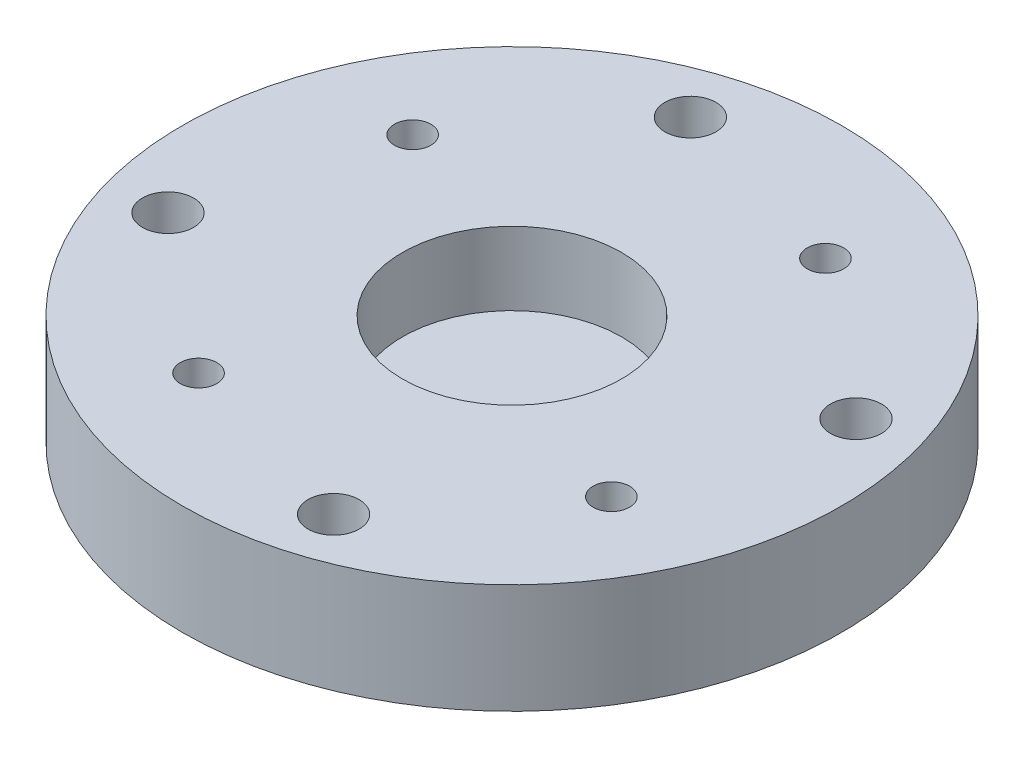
ISO-10303-21;
HEADER;
FILE_DESCRIPTION(('STEP AP214'),'2;1');
FILE_NAME('part.step','',(''),(''),'','','');
FILE_SCHEMA(('AUTOMOTIVE_DESIGN { 1 0 10303 214 1 1 1 1 }'));
ENDSEC;
DATA;
#1=APPLICATION_CONTEXT('core data for automotive mechanical design processes');
#2=APPLICATION_PROTOCOL_DEFINITION('international standard','automotive_design',2000,#1);
#3=PRODUCT_CONTEXT('',#1,'mechanical');
#4=PRODUCT('Part','Part','',(#3));
#5=PRODUCT_RELATED_PRODUCT_CATEGORY('part','',(#4));
#6=PRODUCT_DEFINITION_FORMATION('','',#4);
#7=PRODUCT_DEFINITION_CONTEXT('part definition',#1,'design');
#8=PRODUCT_DEFINITION('design','',#6,#7);
#9=PRODUCT_DEFINITION_SHAPE('','',#8);
#10=(LENGTH_UNIT() NAMED_UNIT(*) SI_UNIT(.MILLI.,.METRE.));
#11=(NAMED_UNIT(*) PLANE_ANGLE_UNIT() SI_UNIT($,.RADIAN.));
#12=(NAMED_UNIT(*) SI_UNIT($,.STERADIAN.) SOLID_ANGLE_UNIT());
#13=UNCERTAINTY_MEASURE_WITH_UNIT(LENGTH_MEASURE(1.E-05),#10,'distance_accuracy_value','');
#14=(GEOMETRIC_REPRESENTATION_CONTEXT(3) GLOBAL_UNCERTAINTY_ASSIGNED_CONTEXT((#13)) GLOBAL_UNIT_ASSIGNED_CONTEXT((#10,
#11,#12)) REPRESENTATION_CONTEXT('',''));
#15=CARTESIAN_POINT('',(0.,0.,0.));
#16=DIRECTION('',(0.,0.,1.));
#17=DIRECTION('',(1.,0.,0.));
#18=AXIS2_PLACEMENT_3D('',#15,#16,#17);
#19=CARTESIAN_POINT('',(0.,0.,0.));
#20=DIRECTION('',(0.,1.,0.));
#21=DIRECTION('',(0.,0.,1.));
#22=AXIS2_PLACEMENT_3D('',#19,#20,#21);
#23=PLANE('',#22);
#24=CARTESIAN_POINT('',(-28.2469511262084,0.,-14.6495649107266));
#25=DIRECTION('',(0.,-1.,0.));
#26=DIRECTION('',(0.,0.,-1.));
#27=AXIS2_PLACEMENT_3D('',#24,#25,#26);
#28=CIRCLE('',#27,2.5);
#29=CARTESIAN_POINT('',(-28.2469511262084,0.,-17.1495649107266));
#30=VERTEX_POINT('',#29);
#31=EDGE_CURVE('E116',#30,#30,#28,.T.);
#32=ORIENTED_EDGE('',*,*,#31,.F.);
#33=EDGE_LOOP('',(#32));
#34=FACE_BOUND('',#33,.T.);
#35=CARTESIAN_POINT('',(14.6495649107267,0.,-28.2469511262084));
#36=DIRECTION('',(0.,-1.,0.));
#37=DIRECTION('',(0.,0.,-1.));
#38=AXIS2_PLACEMENT_3D('',#35,#36,#37);
#39=CIRCLE('',#38,2.5);
#40=CARTESIAN_POINT('',(14.6495649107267,0.,-30.7469511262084));
#41=VERTEX_POINT('',#40);
#42=EDGE_CURVE('E110',#41,#41,#39,.T.);
#43=ORIENTED_EDGE('',*,*,#42,.F.);
#44=EDGE_LOOP('',(#43));
#45=FACE_BOUND('',#44,.T.);
#46=CARTESIAN_POINT('',(28.2469511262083,0.,14.6495649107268));
#47=DIRECTION('',(0.,-1.,0.));
#48=DIRECTION('',(0.,0.,-1.));
#49=AXIS2_PLACEMENT_3D('',#46,#47,#48);
#50=CIRCLE('',#49,2.5);
#51=CARTESIAN_POINT('',(28.2469511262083,0.,12.1495649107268));
#52=VERTEX_POINT('',#51);
#53=EDGE_CURVE('E104',#52,#52,#50,.T.);
#54=ORIENTED_EDGE('',*,*,#53,.F.);
#55=EDGE_LOOP('',(#54));
#56=FACE_BOUND('',#55,.T.);
#57=CARTESIAN_POINT('',(-14.6495649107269,0.,28.2469511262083));
#58=DIRECTION('',(0.,-1.,0.));
#59=DIRECTION('',(0.,0.,-1.));
#60=AXIS2_PLACEMENT_3D('',#57,#58,#59);
#61=CIRCLE('',#60,2.5);
#62=CARTESIAN_POINT('',(-14.6495649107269,0.,25.7469511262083));
#63=VERTEX_POINT('',#62);
#64=EDGE_CURVE('E98',#63,#63,#61,.T.);
#65=ORIENTED_EDGE('',*,*,#64,.F.);
#66=EDGE_LOOP('',(#65));
#67=FACE_BOUND('',#66,.T.);
#68=CARTESIAN_POINT('',(-11.3311551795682,0.,-35.7470966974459));
#69=DIRECTION('',(0.,-1.,0.));
#70=DIRECTION('',(0.,0.,-1.));
#71=AXIS2_PLACEMENT_3D('',#68,#69,#70);
#72=CIRCLE('',#71,6.);
#73=CARTESIAN_POINT('',(-11.3311551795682,0.,-41.7470966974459));
#74=VERTEX_POINT('',#73);
#75=EDGE_CURVE('E92',#74,#74,#72,.T.);
#76=ORIENTED_EDGE('',*,*,#75,.F.);
#77=EDGE_LOOP('',(#76));
#78=FACE_BOUND('',#77,.T.);
#79=CARTESIAN_POINT('',(35.7470966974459,0.,-11.3311551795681));
#80=DIRECTION('',(0.,-1.,0.));
#81=DIRECTION('',(0.,0.,-1.));
#82=AXIS2_PLACEMENT_3D('',#79,#80,#81);
#83=CIRCLE('',#82,6.);
#84=CARTESIAN_POINT('',(35.7470966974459,0.,-17.3311551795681));
#85=VERTEX_POINT('',#84);
#86=EDGE_CURVE('E80',#85,#85,#83,.T.);
#87=ORIENTED_EDGE('',*,*,#86,.F.);
#88=EDGE_LOOP('',(#87));
#89=FACE_BOUND('',#88,.T.);
#90=CARTESIAN_POINT('',(11.331155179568,0.,35.7470966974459));
#91=DIRECTION('',(0.,-1.,0.));
#92=DIRECTION('',(0.,0.,-1.));
#93=AXIS2_PLACEMENT_3D('',#90,#91,#92);
#94=CIRCLE('',#93,6.);
#95=CARTESIAN_POINT('',(11.331155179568,0.,29.7470966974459));
#96=VERTEX_POINT('',#95);
#97=EDGE_CURVE('E68',#96,#96,#94,.T.);
#98=ORIENTED_EDGE('',*,*,#97,.F.);
#99=EDGE_LOOP('',(#98));
#100=FACE_BOUND('',#99,.T.);
#101=CARTESIAN_POINT('',(-35.747096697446,0.,11.3311551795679));
#102=DIRECTION('',(0.,-1.,0.));
#103=DIRECTION('',(0.,0.,-1.));
#104=AXIS2_PLACEMENT_3D('',#101,#102,#103);
#105=CIRCLE('',#104,6.);
#106=CARTESIAN_POINT('',(-35.747096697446,0.,5.33115517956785));
#107=VERTEX_POINT('',#106);
#108=EDGE_CURVE('E56',#107,#107,#105,.T.);
#109=ORIENTED_EDGE('',*,*,#108,.F.);
#110=EDGE_LOOP('',(#109));
#111=FACE_BOUND('',#110,.T.);
#112=CARTESIAN_POINT('',(0.,0.,0.));
#113=DIRECTION('',(0.,1.,0.));
#114=DIRECTION('',(0.,0.,1.));
#115=AXIS2_PLACEMENT_3D('',#112,#113,#114);
#116=CIRCLE('',#115,45.1);
#117=CARTESIAN_POINT('',(0.,0.,45.1));
#118=VERTEX_POINT('',#117);
#119=EDGE_CURVE('E10',#118,#118,#116,.T.);
#120=ORIENTED_EDGE('',*,*,#119,.F.);
#121=EDGE_LOOP('',(#120));
#122=FACE_BOUND('',#121,.T.);
#123=ADVANCED_FACE('F28',(#34,#45,#56,#67,#78,#89,#100,#111,#122),#23,.F.);
#124=CARTESIAN_POINT('',(0.,28.1712458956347,0.));
#125=DIRECTION('',(0.,1.,0.));
#126=DIRECTION('',(0.,0.,1.));
#127=AXIS2_PLACEMENT_3D('',#124,#125,#126);
#128=CYLINDRICAL_SURFACE('',#127,45.1);
#129=CARTESIAN_POINT('',(0.,15.,0.));
#130=DIRECTION('',(0.,1.,0.));
#131=DIRECTION('',(0.,0.,1.));
#132=AXIS2_PLACEMENT_3D('',#129,#130,#131);
#133=CIRCLE('',#132,45.1);
#134=CARTESIAN_POINT('',(0.,15.,45.1));
#135=VERTEX_POINT('',#134);
#136=EDGE_CURVE('E34',#135,#135,#133,.T.);
#137=ORIENTED_EDGE('',*,*,#136,.F.);
#138=EDGE_LOOP('',(#137));
#139=FACE_BOUND('',#138,.T.);
#140=ORIENTED_EDGE('',*,*,#119,.T.);
#141=EDGE_LOOP('',(#140));
#142=FACE_BOUND('',#141,.T.);
#143=ADVANCED_FACE('F124',(#139,#142),#128,.T.);
#144=CARTESIAN_POINT('',(45.1,15.,0.));
#145=DIRECTION('',(0.,-1.,0.));
#146=DIRECTION('',(0.,0.,-1.));
#147=AXIS2_PLACEMENT_3D('',#144,#145,#146);
#148=PLANE('',#147);
#149=CARTESIAN_POINT('',(-28.2469511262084,15.,-14.6495649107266));
#150=DIRECTION('',(0.,-1.,0.));
#151=DIRECTION('',(0.,0.,-1.));
#152=AXIS2_PLACEMENT_3D('',#149,#150,#151);
#153=CIRCLE('',#152,2.5);
#154=CARTESIAN_POINT('',(-28.2469511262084,15.,-17.1495649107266));
#155=VERTEX_POINT('',#154);
#156=EDGE_CURVE('E113',#155,#155,#153,.T.);
#157=ORIENTED_EDGE('',*,*,#156,.T.);
#158=EDGE_LOOP('',(#157));
#159=FACE_BOUND('',#158,.T.);
#160=CARTESIAN_POINT('',(14.6495649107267,15.,-28.2469511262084));
#161=DIRECTION('',(0.,-1.,0.));
#162=DIRECTION('',(0.,0.,-1.));
#163=AXIS2_PLACEMENT_3D('',#160,#161,#162);
#164=CIRCLE('',#163,2.5);
#165=CARTESIAN_POINT('',(14.6495649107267,15.,-30.7469511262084));
#166=VERTEX_POINT('',#165);
#167=EDGE_CURVE('E107',#166,#166,#164,.T.);
#168=ORIENTED_EDGE('',*,*,#167,.T.);
#169=EDGE_LOOP('',(#168));
#170=FACE_BOUND('',#169,.T.);
#171=CARTESIAN_POINT('',(28.2469511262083,15.,14.6495649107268));
#172=DIRECTION('',(0.,-1.,0.));
#173=DIRECTION('',(0.,0.,-1.));
#174=AXIS2_PLACEMENT_3D('',#171,#172,#173);
#175=CIRCLE('',#174,2.5);
#176=CARTESIAN_POINT('',(28.2469511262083,15.,12.1495649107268));
#177=VERTEX_POINT('',#176);
#178=EDGE_CURVE('E101',#177,#177,#175,.T.);
#179=ORIENTED_EDGE('',*,*,#178,.T.);
#180=EDGE_LOOP('',(#179));
#181=FACE_BOUND('',#180,.T.);
#182=CARTESIAN_POINT('',(-14.6495649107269,15.,28.2469511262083));
#183=DIRECTION('',(0.,-1.,0.));
#184=DIRECTION('',(0.,0.,-1.));
#185=AXIS2_PLACEMENT_3D('',#182,#183,#184);
#186=CIRCLE('',#185,2.5);
#187=CARTESIAN_POINT('',(-14.6495649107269,15.,25.7469511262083));
#188=VERTEX_POINT('',#187);
#189=EDGE_CURVE('E95',#188,#188,#186,.T.);
#190=ORIENTED_EDGE('',*,*,#189,.T.);
#191=EDGE_LOOP('',(#190));
#192=FACE_BOUND('',#191,.T.);
#193=CARTESIAN_POINT('',(-11.3311551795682,15.,-35.7470966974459));
#194=DIRECTION('',(0.,-1.,0.));
#195=DIRECTION('',(0.,0.,-1.));
#196=AXIS2_PLACEMENT_3D('',#193,#194,#195);
#197=CIRCLE('',#196,3.5);
#198=CARTESIAN_POINT('',(-11.3311551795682,15.,-39.2470966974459));
#199=VERTEX_POINT('',#198);
#200=EDGE_CURVE('E83',#199,#199,#197,.T.);
#201=ORIENTED_EDGE('',*,*,#200,.T.);
#202=EDGE_LOOP('',(#201));
#203=FACE_BOUND('',#202,.T.);
#204=CARTESIAN_POINT('',(35.7470966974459,15.,-11.3311551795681));
#205=DIRECTION('',(0.,-1.,0.));
#206=DIRECTION('',(0.,0.,-1.));
#207=AXIS2_PLACEMENT_3D('',#204,#205,#206);
#208=CIRCLE('',#207,3.5);
#209=CARTESIAN_POINT('',(35.7470966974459,15.,-14.8311551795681));
#210=VERTEX_POINT('',#209);
#211=EDGE_CURVE('E71',#210,#210,#208,.T.);
#212=ORIENTED_EDGE('',*,*,#211,.T.);
#213=EDGE_LOOP('',(#212));
#214=FACE_BOUND('',#213,.T.);
#215=CARTESIAN_POINT('',(11.331155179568,15.,35.7470966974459));
#216=DIRECTION('',(0.,-1.,0.));
#217=DIRECTION('',(0.,0.,-1.));
#218=AXIS2_PLACEMENT_3D('',#215,#216,#217);
#219=CIRCLE('',#218,3.5);
#220=CARTESIAN_POINT('',(11.331155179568,15.,32.2470966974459));
#221=VERTEX_POINT('',#220);
#222=EDGE_CURVE('E59',#221,#221,#219,.T.);
#223=ORIENTED_EDGE('',*,*,#222,.T.);
#224=EDGE_LOOP('',(#223));
#225=FACE_BOUND('',#224,.T.);
#226=CARTESIAN_POINT('',(-35.747096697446,15.,11.3311551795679));
#227=DIRECTION('',(0.,-1.,0.));
#228=DIRECTION('',(0.,0.,-1.));
#229=AXIS2_PLACEMENT_3D('',#226,#227,#228);
#230=CIRCLE('',#229,3.5);
#231=CARTESIAN_POINT('',(-35.747096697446,15.,7.83115517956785));
#232=VERTEX_POINT('',#231);
#233=EDGE_CURVE('E47',#232,#232,#230,.T.);
#234=ORIENTED_EDGE('',*,*,#233,.T.);
#235=EDGE_LOOP('',(#234));
#236=FACE_BOUND('',#235,.T.);
#237=CARTESIAN_POINT('',(0.,15.,0.));
#238=DIRECTION('',(0.,1.,0.));
#239=DIRECTION('',(0.,0.,1.));
#240=AXIS2_PLACEMENT_3D('',#237,#238,#239);
#241=CIRCLE('',#240,15.);
#242=CARTESIAN_POINT('',(0.,15.,15.));
#243=VERTEX_POINT('',#242);
#244=EDGE_CURVE('E38',#243,#243,#241,.T.);
#245=ORIENTED_EDGE('',*,*,#244,.F.);
#246=EDGE_LOOP('',(#245));
#247=FACE_BOUND('',#246,.T.);
#248=ORIENTED_EDGE('',*,*,#136,.T.);
#249=EDGE_LOOP('',(#248));
#250=FACE_BOUND('',#249,.T.);
#251=ADVANCED_FACE('F169',(#159,#170,#181,#192,#203,#214,#225,#236,#247,#250),#148,.F.);
#252=CARTESIAN_POINT('',(0.,28.1712458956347,0.));
#253=DIRECTION('',(0.,1.,0.));
#254=DIRECTION('',(0.,0.,1.));
#255=AXIS2_PLACEMENT_3D('',#252,#253,#254);
#256=CYLINDRICAL_SURFACE('',#255,15.);
#257=CARTESIAN_POINT('',(0.,4.99999999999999,0.));
#258=DIRECTION('',(0.,1.,0.));
#259=DIRECTION('',(0.,0.,1.));
#260=AXIS2_PLACEMENT_3D('',#257,#258,#259);
#261=CIRCLE('',#260,15.);
#262=CARTESIAN_POINT('',(0.,4.99999999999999,15.));
#263=VERTEX_POINT('',#262);
#264=EDGE_CURVE('E42',#263,#263,#261,.T.);
#265=ORIENTED_EDGE('',*,*,#264,.F.);
#266=EDGE_LOOP('',(#265));
#267=FACE_BOUND('',#266,.T.);
#268=ORIENTED_EDGE('',*,*,#244,.T.);
#269=EDGE_LOOP('',(#268));
#270=FACE_BOUND('',#269,.T.);
#271=ADVANCED_FACE('F165',(#267,#270),#256,.F.);
#272=CARTESIAN_POINT('',(15.,4.99999999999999,0.));
#273=DIRECTION('',(0.,-1.,0.));
#274=DIRECTION('',(0.,0.,-1.));
#275=AXIS2_PLACEMENT_3D('',#272,#273,#274);
#276=PLANE('',#275);
#277=ORIENTED_EDGE('',*,*,#264,.T.);
#278=EDGE_LOOP('',(#277));
#279=FACE_BOUND('',#278,.T.);
#280=ADVANCED_FACE('F161',(#279),#276,.F.);
#281=CARTESIAN_POINT('',(-35.747096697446,0.,11.3311551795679));
#282=DIRECTION('',(0.,-1.,0.));
#283=DIRECTION('',(0.,0.,-1.));
#284=AXIS2_PLACEMENT_3D('',#281,#282,#283);
#285=CYLINDRICAL_SURFACE('',#284,3.5);
#286=ORIENTED_EDGE('',*,*,#233,.F.);
#287=EDGE_LOOP('',(#286));
#288=FACE_BOUND('',#287,.T.);
#289=CARTESIAN_POINT('',(-35.747096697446,7.,11.3311551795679));
#290=DIRECTION('',(0.,-1.,0.));
#291=DIRECTION('',(0.,0.,-1.));
#292=AXIS2_PLACEMENT_3D('',#289,#290,#291);
#293=CIRCLE('',#292,3.5);
#294=CARTESIAN_POINT('',(-35.747096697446,7.,7.83115517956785));
#295=VERTEX_POINT('',#294);
#296=EDGE_CURVE('E50',#295,#295,#293,.T.);
#297=ORIENTED_EDGE('',*,*,#296,.T.);
#298=EDGE_LOOP('',(#297));
#299=FACE_BOUND('',#298,.T.);
#300=ADVANCED_FACE('F153',(#288,#299),#285,.F.);
#301=CARTESIAN_POINT('',(-32.247096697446,7.,11.3311551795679));
#302=DIRECTION('',(0.,1.,0.));
#303=DIRECTION('',(0.,0.,1.));
#304=AXIS2_PLACEMENT_3D('',#301,#302,#303);
#305=PLANE('',#304);
#306=ORIENTED_EDGE('',*,*,#296,.F.);
#307=EDGE_LOOP('',(#306));
#308=FACE_BOUND('',#307,.T.);
#309=CARTESIAN_POINT('',(-35.747096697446,7.,11.3311551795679));
#310=DIRECTION('',(0.,-1.,0.));
#311=DIRECTION('',(0.,0.,-1.));
#312=AXIS2_PLACEMENT_3D('',#309,#310,#311);
#313=CIRCLE('',#312,6.);
#314=CARTESIAN_POINT('',(-35.747096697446,7.,5.33115517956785));
#315=VERTEX_POINT('',#314);
#316=EDGE_CURVE('E53',#315,#315,#313,.T.);
#317=ORIENTED_EDGE('',*,*,#316,.T.);
#318=EDGE_LOOP('',(#317));
#319=FACE_BOUND('',#318,.T.);
#320=ADVANCED_FACE('F143',(#308,#319),#305,.F.);
#321=CARTESIAN_POINT('',(-35.747096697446,0.,11.3311551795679));
#322=DIRECTION('',(0.,-1.,0.));
#323=DIRECTION('',(0.,0.,-1.));
#324=AXIS2_PLACEMENT_3D('',#321,#322,#323);
#325=CYLINDRICAL_SURFACE('',#324,6.);
#326=ORIENTED_EDGE('',*,*,#316,.F.);
#327=EDGE_LOOP('',(#326));
#328=FACE_BOUND('',#327,.T.);
#329=ORIENTED_EDGE('',*,*,#108,.T.);
#330=EDGE_LOOP('',(#329));
#331=FACE_BOUND('',#330,.T.);
#332=ADVANCED_FACE('F140',(#328,#331),#325,.F.);
#333=CARTESIAN_POINT('',(11.331155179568,0.,35.7470966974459));
#334=DIRECTION('',(0.,-1.,0.));
#335=DIRECTION('',(0.,0.,-1.));
#336=AXIS2_PLACEMENT_3D('',#333,#334,#335);
#337=CYLINDRICAL_SURFACE('',#336,3.5);
#338=ORIENTED_EDGE('',*,*,#222,.F.);
#339=EDGE_LOOP('',(#338));
#340=FACE_BOUND('',#339,.T.);
#341=CARTESIAN_POINT('',(11.331155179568,7.,35.7470966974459));
#342=DIRECTION('',(0.,-1.,0.));
#343=DIRECTION('',(0.,0.,-1.));
#344=AXIS2_PLACEMENT_3D('',#341,#342,#343);
#345=CIRCLE('',#344,3.5);
#346=CARTESIAN_POINT('',(11.331155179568,7.,32.2470966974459));
#347=VERTEX_POINT('',#346);
#348=EDGE_CURVE('E62',#347,#347,#345,.T.);
#349=ORIENTED_EDGE('',*,*,#348,.T.);
#350=EDGE_LOOP('',(#349));
#351=FACE_BOUND('',#350,.T.);
#352=ADVANCED_FACE('F142',(#340,#351),#337,.F.);
#353=CARTESIAN_POINT('',(14.831155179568,7.,35.7470966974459));
#354=DIRECTION('',(0.,1.,0.));
#355=DIRECTION('',(0.,0.,1.));
#356=AXIS2_PLACEMENT_3D('',#353,#354,#355);
#357=PLANE('',#356);
#358=ORIENTED_EDGE('',*,*,#348,.F.);
#359=EDGE_LOOP('',(#358));
#360=FACE_BOUND('',#359,.T.);
#361=CARTESIAN_POINT('',(11.331155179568,7.,35.7470966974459));
#362=DIRECTION('',(0.,-1.,0.));
#363=DIRECTION('',(0.,0.,-1.));
#364=AXIS2_PLACEMENT_3D('',#361,#362,#363);
#365=CIRCLE('',#364,6.);
#366=CARTESIAN_POINT('',(11.331155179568,7.,29.7470966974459));
#367=VERTEX_POINT('',#366);
#368=EDGE_CURVE('E65',#367,#367,#365,.T.);
#369=ORIENTED_EDGE('',*,*,#368,.T.);
#370=EDGE_LOOP('',(#369));
#371=FACE_BOUND('',#370,.T.);
#372=ADVANCED_FACE('F150',(#360,#371),#357,.F.);
#373=CARTESIAN_POINT('',(11.331155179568,0.,35.7470966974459));
#374=DIRECTION('',(0.,-1.,0.));
#375=DIRECTION('',(0.,0.,-1.));
#376=AXIS2_PLACEMENT_3D('',#373,#374,#375);
#377=CYLINDRICAL_SURFACE('',#376,6.);
#378=ORIENTED_EDGE('',*,*,#368,.F.);
#379=EDGE_LOOP('',(#378));
#380=FACE_BOUND('',#379,.T.);
#381=ORIENTED_EDGE('',*,*,#97,.T.);
#382=EDGE_LOOP('',(#381));
#383=FACE_BOUND('',#382,.T.);
#384=ADVANCED_FACE('F219',(#380,#383),#377,.F.);
#385=CARTESIAN_POINT('',(35.7470966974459,0.,-11.3311551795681));
#386=DIRECTION('',(0.,-1.,0.));
#387=DIRECTION('',(0.,0.,-1.));
#388=AXIS2_PLACEMENT_3D('',#385,#386,#387);
#389=CYLINDRICAL_SURFACE('',#388,3.5);
#390=ORIENTED_EDGE('',*,*,#211,.F.);
#391=EDGE_LOOP('',(#390));
#392=FACE_BOUND('',#391,.T.);
#393=CARTESIAN_POINT('',(35.7470966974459,7.,-11.3311551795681));
#394=DIRECTION('',(0.,-1.,0.));
#395=DIRECTION('',(0.,0.,-1.));
#396=AXIS2_PLACEMENT_3D('',#393,#394,#395);
#397=CIRCLE('',#396,3.5);
#398=CARTESIAN_POINT('',(35.7470966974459,7.,-14.8311551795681));
#399=VERTEX_POINT('',#398);
#400=EDGE_CURVE('E74',#399,#399,#397,.T.);
#401=ORIENTED_EDGE('',*,*,#400,.T.);
#402=EDGE_LOOP('',(#401));
#403=FACE_BOUND('',#402,.T.);
#404=ADVANCED_FACE('F228',(#392,#403),#389,.F.);
#405=CARTESIAN_POINT('',(39.2470966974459,7.,-11.3311551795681));
#406=DIRECTION('',(0.,1.,0.));
#407=DIRECTION('',(0.,0.,1.));
#408=AXIS2_PLACEMENT_3D('',#405,#406,#407);
#409=PLANE('',#408);
#410=ORIENTED_EDGE('',*,*,#400,.F.);
#411=EDGE_LOOP('',(#410));
#412=FACE_BOUND('',#411,.T.);
#413=CARTESIAN_POINT('',(35.7470966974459,7.,-11.3311551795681));
#414=DIRECTION('',(0.,-1.,0.));
#415=DIRECTION('',(0.,0.,-1.));
#416=AXIS2_PLACEMENT_3D('',#413,#414,#415);
#417=CIRCLE('',#416,6.);
#418=CARTESIAN_POINT('',(35.7470966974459,7.,-17.3311551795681));
#419=VERTEX_POINT('',#418);
#420=EDGE_CURVE('E77',#419,#419,#417,.T.);
#421=ORIENTED_EDGE('',*,*,#420,.T.);
#422=EDGE_LOOP('',(#421));
#423=FACE_BOUND('',#422,.T.);
#424=ADVANCED_FACE('F238',(#412,#423),#409,.F.);
#425=CARTESIAN_POINT('',(35.7470966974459,0.,-11.3311551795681));
#426=DIRECTION('',(0.,-1.,0.));
#427=DIRECTION('',(0.,0.,-1.));
#428=AXIS2_PLACEMENT_3D('',#425,#426,#427);
#429=CYLINDRICAL_SURFACE('',#428,6.);
#430=ORIENTED_EDGE('',*,*,#420,.F.);
#431=EDGE_LOOP('',(#430));
#432=FACE_BOUND('',#431,.T.);
#433=ORIENTED_EDGE('',*,*,#86,.T.);
#434=EDGE_LOOP('',(#433));
#435=FACE_BOUND('',#434,.T.);
#436=ADVANCED_FACE('F248',(#432,#435),#429,.F.);
#437=CARTESIAN_POINT('',(-11.3311551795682,0.,-35.7470966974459));
#438=DIRECTION('',(0.,-1.,0.));
#439=DIRECTION('',(0.,0.,-1.));
#440=AXIS2_PLACEMENT_3D('',#437,#438,#439);
#441=CYLINDRICAL_SURFACE('',#440,3.5);
#442=ORIENTED_EDGE('',*,*,#200,.F.);
#443=EDGE_LOOP('',(#442));
#444=FACE_BOUND('',#443,.T.);
#445=CARTESIAN_POINT('',(-11.3311551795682,7.,-35.7470966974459));
#446=DIRECTION('',(0.,-1.,0.));
#447=DIRECTION('',(0.,0.,-1.));
#448=AXIS2_PLACEMENT_3D('',#445,#446,#447);
#449=CIRCLE('',#448,3.5);
#450=CARTESIAN_POINT('',(-11.3311551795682,7.,-39.2470966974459));
#451=VERTEX_POINT('',#450);
#452=EDGE_CURVE('E86',#451,#451,#449,.T.);
#453=ORIENTED_EDGE('',*,*,#452,.T.);
#454=EDGE_LOOP('',(#453));
#455=FACE_BOUND('',#454,.T.);
#456=ADVANCED_FACE('F258',(#444,#455),#441,.F.);
#457=CARTESIAN_POINT('',(-7.83115517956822,7.,-35.7470966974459));
#458=DIRECTION('',(0.,1.,0.));
#459=DIRECTION('',(0.,0.,1.));
#460=AXIS2_PLACEMENT_3D('',#457,#458,#459);
#461=PLANE('',#460);
#462=ORIENTED_EDGE('',*,*,#452,.F.);
#463=EDGE_LOOP('',(#462));
#464=FACE_BOUND('',#463,.T.);
#465=CARTESIAN_POINT('',(-11.3311551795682,7.,-35.7470966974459));
#466=DIRECTION('',(0.,-1.,0.));
#467=DIRECTION('',(0.,0.,-1.));
#468=AXIS2_PLACEMENT_3D('',#465,#466,#467);
#469=CIRCLE('',#468,6.);
#470=CARTESIAN_POINT('',(-11.3311551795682,7.,-41.7470966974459));
#471=VERTEX_POINT('',#470);
#472=EDGE_CURVE('E89',#471,#471,#469,.T.);
#473=ORIENTED_EDGE('',*,*,#472,.T.);
#474=EDGE_LOOP('',(#473));
#475=FACE_BOUND('',#474,.T.);
#476=ADVANCED_FACE('F268',(#464,#475),#461,.F.);
#477=CARTESIAN_POINT('',(-11.3311551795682,0.,-35.7470966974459));
#478=DIRECTION('',(0.,-1.,0.));
#479=DIRECTION('',(0.,0.,-1.));
#480=AXIS2_PLACEMENT_3D('',#477,#478,#479);
#481=CYLINDRICAL_SURFACE('',#480,6.);
#482=ORIENTED_EDGE('',*,*,#472,.F.);
#483=EDGE_LOOP('',(#482));
#484=FACE_BOUND('',#483,.T.);
#485=ORIENTED_EDGE('',*,*,#75,.T.);
#486=EDGE_LOOP('',(#485));
#487=FACE_BOUND('',#486,.T.);
#488=ADVANCED_FACE('F278',(#484,#487),#481,.F.);
#489=CARTESIAN_POINT('',(-14.6495649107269,0.,28.2469511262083));
#490=DIRECTION('',(0.,-1.,0.));
#491=DIRECTION('',(0.,0.,-1.));
#492=AXIS2_PLACEMENT_3D('',#489,#490,#491);
#493=CYLINDRICAL_SURFACE('',#492,2.5);
#494=ORIENTED_EDGE('',*,*,#189,.F.);
#495=EDGE_LOOP('',(#494));
#496=FACE_BOUND('',#495,.T.);
#497=ORIENTED_EDGE('',*,*,#64,.T.);
#498=EDGE_LOOP('',(#497));
#499=FACE_BOUND('',#498,.T.);
#500=ADVANCED_FACE('F288',(#496,#499),#493,.F.);
#501=CARTESIAN_POINT('',(28.2469511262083,0.,14.6495649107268));
#502=DIRECTION('',(0.,-1.,0.));
#503=DIRECTION('',(0.,0.,-1.));
#504=AXIS2_PLACEMENT_3D('',#501,#502,#503);
#505=CYLINDRICAL_SURFACE('',#504,2.5);
#506=ORIENTED_EDGE('',*,*,#178,.F.);
#507=EDGE_LOOP('',(#506));
#508=FACE_BOUND('',#507,.T.);
#509=ORIENTED_EDGE('',*,*,#53,.T.);
#510=EDGE_LOOP('',(#509));
#511=FACE_BOUND('',#510,.T.);
#512=ADVANCED_FACE('F297',(#508,#511),#505,.F.);
#513=CARTESIAN_POINT('',(14.6495649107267,0.,-28.2469511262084));
#514=DIRECTION('',(0.,-1.,0.));
#515=DIRECTION('',(0.,0.,-1.));
#516=AXIS2_PLACEMENT_3D('',#513,#514,#515);
#517=CYLINDRICAL_SURFACE('',#516,2.5);
#518=ORIENTED_EDGE('',*,*,#167,.F.);
#519=EDGE_LOOP('',(#518));
#520=FACE_BOUND('',#519,.T.);
#521=ORIENTED_EDGE('',*,*,#42,.T.);
#522=EDGE_LOOP('',(#521));
#523=FACE_BOUND('',#522,.T.);
#524=ADVANCED_FACE('F321',(#520,#523),#517,.F.);
#525=CARTESIAN_POINT('',(-28.2469511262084,0.,-14.6495649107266));
#526=DIRECTION('',(0.,-1.,0.));
#527=DIRECTION('',(0.,0.,-1.));
#528=AXIS2_PLACEMENT_3D('',#525,#526,#527);
#529=CYLINDRICAL_SURFACE('',#528,2.5);
#530=ORIENTED_EDGE('',*,*,#156,.F.);
#531=EDGE_LOOP('',(#530));
#532=FACE_BOUND('',#531,.T.);
#533=ORIENTED_EDGE('',*,*,#31,.T.);
#534=EDGE_LOOP('',(#533));
#535=FACE_BOUND('',#534,.T.);
#536=ADVANCED_FACE('F120',(#532,#535),#529,.F.);
#537=CLOSED_SHELL('',(#123,#143,#251,#271,#280,#300,#320,#332,#352,#372,#384,#404,#424,#436,
#456,#476,#488,#500,#512,#524,#536));
#538=MANIFOLD_SOLID_BREP('B2',#537);
#539=ADVANCED_BREP_SHAPE_REPRESENTATION('',(#18,#538),#14);
#540=SHAPE_DEFINITION_REPRESENTATION(#9,#539);
ENDSEC;
END-ISO-10303-21;
